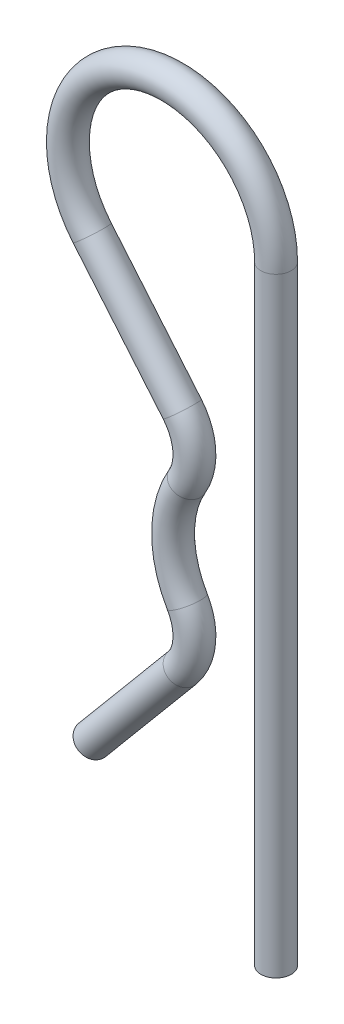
from build123d import *

# Parameters (mm, degrees)
ESQUISSE2_R = 1.75


with BuildPart() as part:
    # Base-Balayage: sweep along a path in Esquisse4
    with BuildLine(Plane.XY) as base_balayage_path:
        Line((0, -37.238401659), (0, 33.011598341))
        ThreePointArc((0, 33.011598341), (-16.099644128, 44.289582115), (-21.19881967, 25.305645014))
        Line((-21.19881967, 25.305645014), (-10.812686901, 12.907417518))
        ThreePointArc((-10.812686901, 12.907417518), (-9.432788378, 9.552307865), (-10.238805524, 6.01518798))
        ThreePointArc((-10.238805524, 6.01518798), (-11.875, 0), (-10.238805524, -6.01518798))
        ThreePointArc((-10.238805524, -6.01518798), (-9.432788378, -9.552307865), (-10.812686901, -12.907417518))
        Line((-10.812686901, -12.907417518), (-21.19881967, -25.305645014))
    # Esquisse2 → Base-Balayage (sweep)
    with BuildSketch(Plane(origin=(0, -37.238401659, 0), x_dir=(1, 0, 0), z_dir=(0, 1, 0))):
        Circle(ESQUISSE2_R)
    sweep(path=base_balayage_path.line)


solid = part.part
